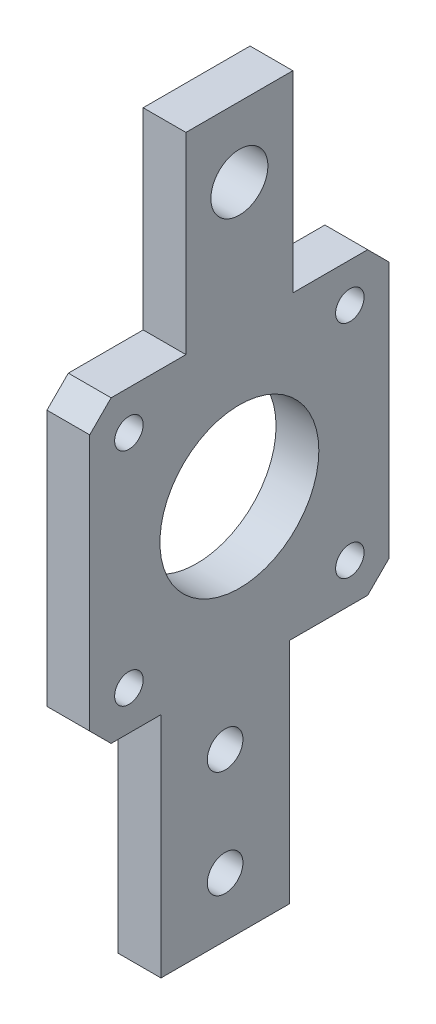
ISO-10303-21;
HEADER;
FILE_DESCRIPTION(('STEP AP214'),'2;1');
FILE_NAME('part.step','',(''),(''),'','','');
FILE_SCHEMA(('AUTOMOTIVE_DESIGN { 1 0 10303 214 1 1 1 1 }'));
ENDSEC;
DATA;
#1=APPLICATION_CONTEXT('core data for automotive mechanical design processes');
#2=APPLICATION_PROTOCOL_DEFINITION('international standard','automotive_design',2000,#1);
#3=PRODUCT_CONTEXT('',#1,'mechanical');
#4=PRODUCT('Part','Part','',(#3));
#5=PRODUCT_RELATED_PRODUCT_CATEGORY('part','',(#4));
#6=PRODUCT_DEFINITION_FORMATION('','',#4);
#7=PRODUCT_DEFINITION_CONTEXT('part definition',#1,'design');
#8=PRODUCT_DEFINITION('design','',#6,#7);
#9=PRODUCT_DEFINITION_SHAPE('','',#8);
#10=(LENGTH_UNIT() NAMED_UNIT(*) SI_UNIT(.MILLI.,.METRE.));
#11=(NAMED_UNIT(*) PLANE_ANGLE_UNIT() SI_UNIT($,.RADIAN.));
#12=(NAMED_UNIT(*) SI_UNIT($,.STERADIAN.) SOLID_ANGLE_UNIT());
#13=UNCERTAINTY_MEASURE_WITH_UNIT(LENGTH_MEASURE(1.E-05),#10,'distance_accuracy_value','');
#14=(GEOMETRIC_REPRESENTATION_CONTEXT(3) GLOBAL_UNCERTAINTY_ASSIGNED_CONTEXT((#13)) GLOBAL_UNIT_ASSIGNED_CONTEXT((#10,
#11,#12)) REPRESENTATION_CONTEXT('',''));
#15=CARTESIAN_POINT('',(0.,0.,0.));
#16=DIRECTION('',(0.,0.,1.));
#17=DIRECTION('',(1.,0.,0.));
#18=AXIS2_PLACEMENT_3D('',#15,#16,#17);
#19=CARTESIAN_POINT('',(3.00000002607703,-36.9999995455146,10.9999999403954));
#20=DIRECTION('',(0.,0.,1.));
#21=DIRECTION('',(1.,0.,0.));
#22=AXIS2_PLACEMENT_3D('',#19,#20,#21);
#23=PLANE('',#22);
#24=DIRECTION('',(1.,0.,0.));
#25=VECTOR('',#24,1.);
#26=CARTESIAN_POINT('',(3.00000002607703,-20.9999997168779,10.9999999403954));
#27=LINE('',#26,#25);
#28=CARTESIAN_POINT('',(0.,-20.9999997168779,10.9999999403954));
#29=VERTEX_POINT('',#28);
#30=CARTESIAN_POINT('',(6.00000005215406,-20.9999997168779,10.9999999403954));
#31=VERTEX_POINT('',#30);
#32=EDGE_CURVE('E262',#29,#31,#27,.T.);
#33=ORIENTED_EDGE('',*,*,#32,.F.);
#34=DIRECTION('',(0.,1.,0.));
#35=VECTOR('',#34,1.);
#36=CARTESIAN_POINT('',(0.,-36.9999995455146,10.9999999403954));
#37=LINE('',#36,#35);
#38=CARTESIAN_POINT('',(0.,-52.9999993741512,10.9999999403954));
#39=VERTEX_POINT('',#38);
#40=EDGE_CURVE('E223',#29,#39,#37,.F.);
#41=ORIENTED_EDGE('',*,*,#40,.T.);
#42=DIRECTION('',(1.,0.,0.));
#43=VECTOR('',#42,1.);
#44=CARTESIAN_POINT('',(3.00000002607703,-52.9999993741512,10.9999999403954));
#45=LINE('',#44,#43);
#46=CARTESIAN_POINT('',(6.00000005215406,-52.9999993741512,10.9999999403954));
#47=VERTEX_POINT('',#46);
#48=EDGE_CURVE('E271',#39,#47,#45,.T.);
#49=ORIENTED_EDGE('',*,*,#48,.T.);
#50=DIRECTION('',(0.,-1.,0.));
#51=VECTOR('',#50,1.);
#52=CARTESIAN_POINT('',(6.00000005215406,-6.99999928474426,10.9999999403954));
#53=LINE('',#52,#51);
#54=EDGE_CURVE('E268',#31,#47,#53,.T.);
#55=ORIENTED_EDGE('',*,*,#54,.F.);
#56=EDGE_LOOP('',(#33,#41,#49,#55));
#57=FACE_BOUND('',#56,.T.);
#58=ADVANCED_FACE('F64',(#57),#23,.T.);
#59=CARTESIAN_POINT('',(3.00000002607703,-52.9999993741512,1.99999986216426));
#60=DIRECTION('',(0.,-1.,0.));
#61=DIRECTION('',(0.,0.,-1.));
#62=AXIS2_PLACEMENT_3D('',#59,#60,#61);
#63=PLANE('',#62);
#64=ORIENTED_EDGE('',*,*,#48,.F.);
#65=DIRECTION('',(0.,0.,1.));
#66=VECTOR('',#65,1.);
#67=CARTESIAN_POINT('',(0.,-52.9999993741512,1.99999986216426));
#68=LINE('',#67,#66);
#69=CARTESIAN_POINT('',(0.,-52.9999993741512,-7.00000021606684));
#70=VERTEX_POINT('',#69);
#71=EDGE_CURVE('E227',#39,#70,#68,.F.);
#72=ORIENTED_EDGE('',*,*,#71,.T.);
#73=DIRECTION('',(-1.,0.,0.));
#74=VECTOR('',#73,1.);
#75=CARTESIAN_POINT('',(3.00000002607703,-52.9999993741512,-7.00000021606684));
#76=LINE('',#75,#74);
#77=CARTESIAN_POINT('',(6.00000005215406,-52.9999993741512,-7.00000021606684));
#78=VERTEX_POINT('',#77);
#79=EDGE_CURVE('E84',#70,#78,#76,.F.);
#80=ORIENTED_EDGE('',*,*,#79,.T.);
#81=DIRECTION('',(0.,0.,-1.));
#82=VECTOR('',#81,1.);
#83=CARTESIAN_POINT('',(6.00000005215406,-52.9999993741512,0.));
#84=LINE('',#83,#82);
#85=EDGE_CURVE('E403',#47,#78,#84,.T.);
#86=ORIENTED_EDGE('',*,*,#85,.F.);
#87=EDGE_LOOP('',(#64,#72,#80,#86));
#88=FACE_BOUND('',#87,.T.);
#89=ADVANCED_FACE('F459',(#88),#63,.T.);
#90=CARTESIAN_POINT('',(3.00000002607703,-36.9999995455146,-7.00000021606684));
#91=DIRECTION('',(0.,0.,1.));
#92=DIRECTION('',(1.,0.,0.));
#93=AXIS2_PLACEMENT_3D('',#90,#91,#92);
#94=PLANE('',#93);
#95=ORIENTED_EDGE('',*,*,#79,.F.);
#96=DIRECTION('',(0.,1.,0.));
#97=VECTOR('',#96,1.);
#98=CARTESIAN_POINT('',(0.,-36.9999995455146,-7.00000021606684));
#99=LINE('',#98,#97);
#100=CARTESIAN_POINT('',(0.,-20.9999997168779,-7.00000021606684));
#101=VERTEX_POINT('',#100);
#102=EDGE_CURVE('E228',#70,#101,#99,.T.);
#103=ORIENTED_EDGE('',*,*,#102,.T.);
#104=DIRECTION('',(-1.,0.,0.));
#105=VECTOR('',#104,1.);
#106=CARTESIAN_POINT('',(3.00000002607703,-20.9999997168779,-7.00000021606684));
#107=LINE('',#106,#105);
#108=CARTESIAN_POINT('',(6.00000005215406,-20.9999997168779,-7.00000021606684));
#109=VERTEX_POINT('',#108);
#110=EDGE_CURVE('E289',#101,#109,#107,.F.);
#111=ORIENTED_EDGE('',*,*,#110,.T.);
#112=DIRECTION('',(0.,-1.,0.));
#113=VECTOR('',#112,1.);
#114=CARTESIAN_POINT('',(6.00000005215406,-6.99999928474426,-7.00000021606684));
#115=LINE('',#114,#113);
#116=EDGE_CURVE('E297',#78,#109,#115,.F.);
#117=ORIENTED_EDGE('',*,*,#116,.F.);
#118=EDGE_LOOP('',(#95,#103,#111,#117));
#119=FACE_BOUND('',#118,.T.);
#120=ADVANCED_FACE('F456',(#119),#94,.F.);
#121=CARTESIAN_POINT('',(3.00000002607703,-19.4999991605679,19.4999991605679));
#122=DIRECTION('',(0.,-0.707106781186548,0.707106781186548));
#123=DIRECTION('',(0.,-0.707106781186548,-0.707106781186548));
#124=AXIS2_PLACEMENT_3D('',#121,#122,#123);
#125=PLANE('',#124);
#126=DIRECTION('',(0.,-0.707106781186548,-0.707106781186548));
#127=VECTOR('',#126,1.);
#128=CARTESIAN_POINT('',(6.00000005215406,-22.99999880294,15.9999995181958));
#129=LINE('',#128,#127);
#130=CARTESIAN_POINT('',(6.00000005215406,-17.9999986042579,20.9999997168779));
#131=VERTEX_POINT('',#130);
#132=CARTESIAN_POINT('',(6.00000005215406,-20.9999997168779,17.9999986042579));
#133=VERTEX_POINT('',#132);
#134=EDGE_CURVE('E192',#131,#133,#129,.T.);
#135=ORIENTED_EDGE('',*,*,#134,.F.);
#136=DIRECTION('',(-1.,0.,0.));
#137=VECTOR('',#136,1.);
#138=CARTESIAN_POINT('',(3.00000002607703,-17.9999986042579,20.9999997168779));
#139=LINE('',#138,#137);
#140=CARTESIAN_POINT('',(0.,-17.9999986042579,20.9999997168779));
#141=VERTEX_POINT('',#140);
#142=EDGE_CURVE('E185',#131,#141,#139,.T.);
#143=ORIENTED_EDGE('',*,*,#142,.T.);
#144=DIRECTION('',(0.,0.707106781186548,0.707106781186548));
#145=VECTOR('',#144,1.);
#146=CARTESIAN_POINT('',(0.,-19.4999991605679,19.4999991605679));
#147=LINE('',#146,#145);
#148=CARTESIAN_POINT('',(0.,-20.9999997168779,17.9999986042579));
#149=VERTEX_POINT('',#148);
#150=EDGE_CURVE('E190',#141,#149,#147,.F.);
#151=ORIENTED_EDGE('',*,*,#150,.T.);
#152=DIRECTION('',(1.,0.,0.));
#153=VECTOR('',#152,1.);
#154=CARTESIAN_POINT('',(3.00000002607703,-20.9999997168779,17.9999986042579));
#155=LINE('',#154,#153);
#156=EDGE_CURVE('E214',#149,#133,#155,.T.);
#157=ORIENTED_EDGE('',*,*,#156,.T.);
#158=EDGE_LOOP('',(#135,#143,#151,#157));
#159=FACE_BOUND('',#158,.T.);
#160=ADVANCED_FACE('F187',(#159),#125,.T.);
#161=CARTESIAN_POINT('',(3.00000002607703,0.,20.9999997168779));
#162=DIRECTION('',(0.,0.,1.));
#163=DIRECTION('',(1.,0.,0.));
#164=AXIS2_PLACEMENT_3D('',#161,#162,#163);
#165=PLANE('',#164);
#166=ORIENTED_EDGE('',*,*,#142,.F.);
#167=DIRECTION('',(0.,1.,0.));
#168=VECTOR('',#167,1.);
#169=CARTESIAN_POINT('',(6.00000005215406,0.,20.9999997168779));
#170=LINE('',#169,#168);
#171=CARTESIAN_POINT('',(6.00000005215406,17.9999986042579,20.9999997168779));
#172=VERTEX_POINT('',#171);
#173=EDGE_CURVE('E196',#131,#172,#170,.T.);
#174=ORIENTED_EDGE('',*,*,#173,.T.);
#175=DIRECTION('',(-1.,0.,0.));
#176=VECTOR('',#175,1.);
#177=CARTESIAN_POINT('',(3.00000002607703,17.9999986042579,20.9999997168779));
#178=LINE('',#177,#176);
#179=CARTESIAN_POINT('',(0.,17.9999986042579,20.9999997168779));
#180=VERTEX_POINT('',#179);
#181=EDGE_CURVE('E202',#172,#180,#178,.T.);
#182=ORIENTED_EDGE('',*,*,#181,.T.);
#183=DIRECTION('',(0.,1.,0.));
#184=VECTOR('',#183,1.);
#185=CARTESIAN_POINT('',(0.,0.,20.9999997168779));
#186=LINE('',#185,#184);
#187=EDGE_CURVE('E199',#180,#141,#186,.F.);
#188=ORIENTED_EDGE('',*,*,#187,.T.);
#189=EDGE_LOOP('',(#166,#174,#182,#188));
#190=FACE_BOUND('',#189,.T.);
#191=ADVANCED_FACE('F200',(#190),#165,.T.);
#192=CARTESIAN_POINT('',(3.00000002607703,19.4999991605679,19.4999991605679));
#193=DIRECTION('',(0.,0.707106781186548,0.707106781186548));
#194=DIRECTION('',(0.,-0.707106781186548,0.707106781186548));
#195=AXIS2_PLACEMENT_3D('',#192,#193,#194);
#196=PLANE('',#195);
#197=ORIENTED_EDGE('',*,*,#181,.F.);
#198=DIRECTION('',(0.,-0.707106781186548,0.707106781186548));
#199=VECTOR('',#198,1.);
#200=CARTESIAN_POINT('',(6.00000005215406,15.9999995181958,22.9999988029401));
#201=LINE('',#200,#199);
#202=CARTESIAN_POINT('',(6.00000005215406,20.9999997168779,17.9999986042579));
#203=VERTEX_POINT('',#202);
#204=EDGE_CURVE('E275',#203,#172,#201,.T.);
#205=ORIENTED_EDGE('',*,*,#204,.F.);
#206=DIRECTION('',(-1.,0.,0.));
#207=VECTOR('',#206,1.);
#208=CARTESIAN_POINT('',(3.00000002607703,20.9999997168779,17.9999986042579));
#209=LINE('',#208,#207);
#210=CARTESIAN_POINT('',(0.,20.9999997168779,17.9999986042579));
#211=VERTEX_POINT('',#210);
#212=EDGE_CURVE('E272',#203,#211,#209,.T.);
#213=ORIENTED_EDGE('',*,*,#212,.T.);
#214=DIRECTION('',(0.,0.707106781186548,-0.707106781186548));
#215=VECTOR('',#214,1.);
#216=CARTESIAN_POINT('',(0.,19.4999991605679,19.4999991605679));
#217=LINE('',#216,#215);
#218=EDGE_CURVE('E207',#211,#180,#217,.F.);
#219=ORIENTED_EDGE('',*,*,#218,.T.);
#220=EDGE_LOOP('',(#197,#205,#213,#219));
#221=FACE_BOUND('',#220,.T.);
#222=ADVANCED_FACE('F491',(#221),#196,.T.);
#223=CARTESIAN_POINT('',(3.00000002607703,20.9999997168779,-12.7499995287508));
#224=DIRECTION('',(0.,1.,0.));
#225=DIRECTION('',(0.,0.,1.));
#226=AXIS2_PLACEMENT_3D('',#223,#224,#225);
#227=PLANE('',#226);
#228=DIRECTION('',(0.,0.,1.));
#229=VECTOR('',#228,1.);
#230=CARTESIAN_POINT('',(6.00000005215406,20.9999997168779,0.));
#231=LINE('',#230,#229);
#232=CARTESIAN_POINT('',(6.00000005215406,20.9999997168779,-17.9999986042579));
#233=VERTEX_POINT('',#232);
#234=CARTESIAN_POINT('',(6.00000005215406,20.9999997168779,-7.49999983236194));
#235=VERTEX_POINT('',#234);
#236=EDGE_CURVE('E235',#233,#235,#231,.T.);
#237=ORIENTED_EDGE('',*,*,#236,.F.);
#238=DIRECTION('',(1.,0.,0.));
#239=VECTOR('',#238,1.);
#240=CARTESIAN_POINT('',(3.00000002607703,20.9999997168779,-17.9999986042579));
#241=LINE('',#240,#239);
#242=CARTESIAN_POINT('',(0.,20.9999997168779,-17.9999986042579));
#243=VERTEX_POINT('',#242);
#244=EDGE_CURVE('E231',#233,#243,#241,.F.);
#245=ORIENTED_EDGE('',*,*,#244,.T.);
#246=DIRECTION('',(0.,0.,-1.));
#247=VECTOR('',#246,1.);
#248=CARTESIAN_POINT('',(0.,20.9999997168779,-12.7499995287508));
#249=LINE('',#248,#247);
#250=CARTESIAN_POINT('',(0.,20.9999997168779,-7.49999983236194));
#251=VERTEX_POINT('',#250);
#252=EDGE_CURVE('E236',#243,#251,#249,.F.);
#253=ORIENTED_EDGE('',*,*,#252,.T.);
#254=DIRECTION('',(-1.,0.,0.));
#255=VECTOR('',#254,1.);
#256=CARTESIAN_POINT('',(3.00000002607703,20.9999997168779,-7.49999983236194));
#257=LINE('',#256,#255);
#258=EDGE_CURVE('E298',#251,#235,#257,.F.);
#259=ORIENTED_EDGE('',*,*,#258,.T.);
#260=EDGE_LOOP('',(#237,#245,#253,#259));
#261=FACE_BOUND('',#260,.T.);
#262=ADVANCED_FACE('F429',(#261),#227,.T.);
#263=CARTESIAN_POINT('',(6.00000005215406,-6.99999928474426,0.));
#264=DIRECTION('',(1.,0.,0.));
#265=DIRECTION('',(0.,0.,-1.));
#266=AXIS2_PLACEMENT_3D('',#263,#264,#265);
#267=PLANE('',#266);
#268=CARTESIAN_POINT('',(6.00000005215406,38.2,0.));
#269=DIRECTION('',(1.,0.,0.));
#270=DIRECTION('',(0.,0.,-1.));
#271=AXIS2_PLACEMENT_3D('',#268,#269,#270);
#272=CIRCLE('',#271,4.);
#273=CARTESIAN_POINT('',(6.00000005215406,38.2,-4.));
#274=VERTEX_POINT('',#273);
#275=EDGE_CURVE('E352',#274,#274,#272,.T.);
#276=ORIENTED_EDGE('',*,*,#275,.F.);
#277=EDGE_LOOP('',(#276));
#278=FACE_BOUND('',#277,.T.);
#279=CARTESIAN_POINT('',(6.00000005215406,-44.7299993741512,1.99999986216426));
#280=DIRECTION('',(1.,0.,0.));
#281=DIRECTION('',(0.,0.,-1.));
#282=AXIS2_PLACEMENT_3D('',#279,#280,#281);
#283=CIRCLE('',#282,2.5);
#284=CARTESIAN_POINT('',(6.00000005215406,-44.7299993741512,-0.500000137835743));
#285=VERTEX_POINT('',#284);
#286=EDGE_CURVE('E354',#285,#285,#283,.T.);
#287=ORIENTED_EDGE('',*,*,#286,.F.);
#288=EDGE_LOOP('',(#287));
#289=FACE_BOUND('',#288,.T.);
#290=CARTESIAN_POINT('',(6.00000005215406,-29.7299993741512,1.99999986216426));
#291=DIRECTION('',(1.,0.,0.));
#292=DIRECTION('',(0.,0.,-1.));
#293=AXIS2_PLACEMENT_3D('',#290,#291,#292);
#294=CIRCLE('',#293,2.5);
#295=CARTESIAN_POINT('',(6.00000005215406,-29.7299993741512,-0.500000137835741));
#296=VERTEX_POINT('',#295);
#297=EDGE_CURVE('E346',#296,#296,#294,.T.);
#298=ORIENTED_EDGE('',*,*,#297,.F.);
#299=EDGE_LOOP('',(#298));
#300=FACE_BOUND('',#299,.T.);
#301=CARTESIAN_POINT('',(6.00000005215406,0.,0.));
#302=DIRECTION('',(1.,0.,0.));
#303=DIRECTION('',(0.,0.,-1.));
#304=AXIS2_PLACEMENT_3D('',#301,#302,#303);
#305=CIRCLE('',#304,11.15);
#306=CARTESIAN_POINT('',(6.00000005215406,0.,-11.15));
#307=VERTEX_POINT('',#306);
#308=EDGE_CURVE('E374',#307,#307,#305,.T.);
#309=ORIENTED_EDGE('',*,*,#308,.F.);
#310=EDGE_LOOP('',(#309));
#311=FACE_BOUND('',#310,.T.);
#312=CARTESIAN_POINT('',(6.00000005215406,15.4999997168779,15.4999997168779));
#313=DIRECTION('',(1.,0.,0.));
#314=DIRECTION('',(0.,0.,1.));
#315=AXIS2_PLACEMENT_3D('',#312,#313,#314);
#316=CIRCLE('',#315,2.);
#317=CARTESIAN_POINT('',(6.00000005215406,15.4999997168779,17.4999997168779));
#318=VERTEX_POINT('',#317);
#319=EDGE_CURVE('E370',#318,#318,#316,.T.);
#320=ORIENTED_EDGE('',*,*,#319,.F.);
#321=EDGE_LOOP('',(#320));
#322=FACE_BOUND('',#321,.T.);
#323=CARTESIAN_POINT('',(6.00000005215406,-15.5000002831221,15.4999997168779));
#324=DIRECTION('',(1.,0.,0.));
#325=DIRECTION('',(0.,0.,1.));
#326=AXIS2_PLACEMENT_3D('',#323,#324,#325);
#327=CIRCLE('',#326,2.);
#328=CARTESIAN_POINT('',(6.00000005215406,-15.5000002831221,17.4999997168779));
#329=VERTEX_POINT('',#328);
#330=EDGE_CURVE('E366',#329,#329,#327,.T.);
#331=ORIENTED_EDGE('',*,*,#330,.F.);
#332=EDGE_LOOP('',(#331));
#333=FACE_BOUND('',#332,.T.);
#334=CARTESIAN_POINT('',(6.00000005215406,-15.5000002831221,-15.4999997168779));
#335=DIRECTION('',(1.,0.,0.));
#336=DIRECTION('',(0.,0.,-1.));
#337=AXIS2_PLACEMENT_3D('',#334,#335,#336);
#338=CIRCLE('',#337,2.00000000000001);
#339=CARTESIAN_POINT('',(6.00000005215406,-15.5000002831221,-17.4999997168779));
#340=VERTEX_POINT('',#339);
#341=EDGE_CURVE('E362',#340,#340,#338,.T.);
#342=ORIENTED_EDGE('',*,*,#341,.F.);
#343=EDGE_LOOP('',(#342));
#344=FACE_BOUND('',#343,.T.);
#345=CARTESIAN_POINT('',(6.00000005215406,15.4999997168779,-15.4999997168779));
#346=DIRECTION('',(1.,0.,0.));
#347=DIRECTION('',(0.,0.,-1.));
#348=AXIS2_PLACEMENT_3D('',#345,#346,#347);
#349=CIRCLE('',#348,2.);
#350=CARTESIAN_POINT('',(6.00000005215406,15.4999997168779,-17.4999997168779));
#351=VERTEX_POINT('',#350);
#352=EDGE_CURVE('E323',#351,#351,#349,.T.);
#353=ORIENTED_EDGE('',*,*,#352,.F.);
#354=EDGE_LOOP('',(#353));
#355=FACE_BOUND('',#354,.T.);
#356=DIRECTION('',(0.,1.,0.));
#357=VECTOR('',#356,1.);
#358=CARTESIAN_POINT('',(6.00000005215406,0.,-20.9999997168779));
#359=LINE('',#358,#357);
#360=CARTESIAN_POINT('',(6.00000005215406,17.9999986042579,-20.9999997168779));
#361=VERTEX_POINT('',#360);
#362=CARTESIAN_POINT('',(6.00000005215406,-17.9999986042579,-20.9999997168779));
#363=VERTEX_POINT('',#362);
#364=EDGE_CURVE('E75',#361,#363,#359,.F.);
#365=ORIENTED_EDGE('',*,*,#364,.F.);
#366=DIRECTION('',(0.,-0.707106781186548,-0.707106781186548));
#367=VECTOR('',#366,1.);
#368=CARTESIAN_POINT('',(6.00000005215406,15.9999995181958,-22.9999988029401));
#369=LINE('',#368,#367);
#370=EDGE_CURVE('E237',#361,#233,#369,.F.);
#371=ORIENTED_EDGE('',*,*,#370,.T.);
#372=ORIENTED_EDGE('',*,*,#236,.T.);
#373=DIRECTION('',(0.,-1.,0.));
#374=VECTOR('',#373,1.);
#375=CARTESIAN_POINT('',(6.00000005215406,-6.99999928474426,-7.49999983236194));
#376=LINE('',#375,#374);
#377=CARTESIAN_POINT('',(6.00000005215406,48.,-7.49999983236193));
#378=VERTEX_POINT('',#377);
#379=EDGE_CURVE('E303',#235,#378,#376,.F.);
#380=ORIENTED_EDGE('',*,*,#379,.T.);
#381=DIRECTION('',(0.,0.,1.));
#382=VECTOR('',#381,1.);
#383=CARTESIAN_POINT('',(6.00000005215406,48.,7.49999983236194));
#384=LINE('',#383,#382);
#385=CARTESIAN_POINT('',(6.00000005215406,48.,7.49999983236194));
#386=VERTEX_POINT('',#385);
#387=EDGE_CURVE('E342',#378,#386,#384,.T.);
#388=ORIENTED_EDGE('',*,*,#387,.T.);
#389=DIRECTION('',(0.,-1.,0.));
#390=VECTOR('',#389,1.);
#391=CARTESIAN_POINT('',(6.00000005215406,-6.99999928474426,7.49999983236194));
#392=LINE('',#391,#390);
#393=CARTESIAN_POINT('',(6.00000005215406,20.9999997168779,7.49999983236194));
#394=VERTEX_POINT('',#393);
#395=EDGE_CURVE('E162',#386,#394,#392,.T.);
#396=ORIENTED_EDGE('',*,*,#395,.T.);
#397=DIRECTION('',(0.,0.,-1.));
#398=VECTOR('',#397,1.);
#399=CARTESIAN_POINT('',(6.00000005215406,20.9999997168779,12.7499995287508));
#400=LINE('',#399,#398);
#401=EDGE_CURVE('E153',#203,#394,#400,.T.);
#402=ORIENTED_EDGE('',*,*,#401,.F.);
#403=ORIENTED_EDGE('',*,*,#204,.T.);
#404=ORIENTED_EDGE('',*,*,#173,.F.);
#405=ORIENTED_EDGE('',*,*,#134,.T.);
#406=DIRECTION('',(0.,0.,-1.));
#407=VECTOR('',#406,1.);
#408=CARTESIAN_POINT('',(6.00000005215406,-20.9999997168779,0.));
#409=LINE('',#408,#407);
#410=EDGE_CURVE('E218',#133,#31,#409,.T.);
#411=ORIENTED_EDGE('',*,*,#410,.T.);
#412=ORIENTED_EDGE('',*,*,#54,.T.);
#413=ORIENTED_EDGE('',*,*,#85,.T.);
#414=ORIENTED_EDGE('',*,*,#116,.T.);
#415=DIRECTION('',(0.,0.,1.));
#416=VECTOR('',#415,1.);
#417=CARTESIAN_POINT('',(6.00000005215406,-20.9999997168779,-12.4999997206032));
#418=LINE('',#417,#416);
#419=CARTESIAN_POINT('',(6.00000005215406,-20.9999997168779,-17.9999986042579));
#420=VERTEX_POINT('',#419);
#421=EDGE_CURVE('E293',#420,#109,#418,.T.);
#422=ORIENTED_EDGE('',*,*,#421,.F.);
#423=DIRECTION('',(0.,-0.707106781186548,0.707106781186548));
#424=VECTOR('',#423,1.);
#425=CARTESIAN_POINT('',(6.00000005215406,-22.9999988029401,-15.9999995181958));
#426=LINE('',#425,#424);
#427=EDGE_CURVE('E255',#420,#363,#426,.F.);
#428=ORIENTED_EDGE('',*,*,#427,.T.);
#429=EDGE_LOOP('',(#365,#371,#372,#380,#388,#396,#402,#403,#404,#405,#411,#412,#413,#414,#422,#428));
#430=FACE_BOUND('',#429,.T.);
#431=ADVANCED_FACE('F439',(#278,#289,#300,#311,#322,#333,#344,#355,#430),#267,.T.);
#432=CARTESIAN_POINT('',(0.,-6.99999928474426,0.));
#433=DIRECTION('',(1.,0.,0.));
#434=DIRECTION('',(0.,0.,-1.));
#435=AXIS2_PLACEMENT_3D('',#432,#433,#434);
#436=PLANE('',#435);
#437=CARTESIAN_POINT('',(0.,38.2,0.));
#438=DIRECTION('',(1.,0.,0.));
#439=DIRECTION('',(0.,0.,-1.));
#440=AXIS2_PLACEMENT_3D('',#437,#438,#439);
#441=CIRCLE('',#440,4.);
#442=CARTESIAN_POINT('',(0.,38.2,-4.));
#443=VERTEX_POINT('',#442);
#444=EDGE_CURVE('E339',#443,#443,#441,.F.);
#445=ORIENTED_EDGE('',*,*,#444,.F.);
#446=EDGE_LOOP('',(#445));
#447=FACE_BOUND('',#446,.T.);
#448=CARTESIAN_POINT('',(0.,-44.7299993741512,1.99999986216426));
#449=DIRECTION('',(1.,0.,0.));
#450=DIRECTION('',(0.,0.,-1.));
#451=AXIS2_PLACEMENT_3D('',#448,#449,#450);
#452=CIRCLE('',#451,2.5);
#453=CARTESIAN_POINT('',(0.,-44.7299993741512,-0.500000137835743));
#454=VERTEX_POINT('',#453);
#455=EDGE_CURVE('E68',#454,#454,#452,.F.);
#456=ORIENTED_EDGE('',*,*,#455,.F.);
#457=EDGE_LOOP('',(#456));
#458=FACE_BOUND('',#457,.T.);
#459=CARTESIAN_POINT('',(0.,-29.7299993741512,1.99999986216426));
#460=DIRECTION('',(1.,0.,0.));
#461=DIRECTION('',(0.,0.,-1.));
#462=AXIS2_PLACEMENT_3D('',#459,#460,#461);
#463=CIRCLE('',#462,2.5);
#464=CARTESIAN_POINT('',(0.,-29.7299993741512,-0.500000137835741));
#465=VERTEX_POINT('',#464);
#466=EDGE_CURVE('E343',#465,#465,#463,.F.);
#467=ORIENTED_EDGE('',*,*,#466,.F.);
#468=EDGE_LOOP('',(#467));
#469=FACE_BOUND('',#468,.T.);
#470=CARTESIAN_POINT('',(0.,0.,0.));
#471=DIRECTION('',(1.,0.,0.));
#472=DIRECTION('',(0.,0.,-1.));
#473=AXIS2_PLACEMENT_3D('',#470,#471,#472);
#474=CIRCLE('',#473,11.15);
#475=CARTESIAN_POINT('',(0.,0.,-11.15));
#476=VERTEX_POINT('',#475);
#477=EDGE_CURVE('E335',#476,#476,#474,.F.);
#478=ORIENTED_EDGE('',*,*,#477,.F.);
#479=EDGE_LOOP('',(#478));
#480=FACE_BOUND('',#479,.T.);
#481=CARTESIAN_POINT('',(0.,15.4999997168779,15.4999997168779));
#482=DIRECTION('',(1.,0.,0.));
#483=DIRECTION('',(0.,0.,-1.));
#484=AXIS2_PLACEMENT_3D('',#481,#482,#483);
#485=CIRCLE('',#484,2.);
#486=CARTESIAN_POINT('',(0.,15.4999997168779,13.4999997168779));
#487=VERTEX_POINT('',#486);
#488=EDGE_CURVE('E331',#487,#487,#485,.F.);
#489=ORIENTED_EDGE('',*,*,#488,.F.);
#490=EDGE_LOOP('',(#489));
#491=FACE_BOUND('',#490,.T.);
#492=CARTESIAN_POINT('',(0.,-15.5000002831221,15.4999997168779));
#493=DIRECTION('',(1.,0.,0.));
#494=DIRECTION('',(0.,0.,-1.));
#495=AXIS2_PLACEMENT_3D('',#492,#493,#494);
#496=CIRCLE('',#495,2.);
#497=CARTESIAN_POINT('',(0.,-15.5000002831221,13.4999997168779));
#498=VERTEX_POINT('',#497);
#499=EDGE_CURVE('E327',#498,#498,#496,.F.);
#500=ORIENTED_EDGE('',*,*,#499,.F.);
#501=EDGE_LOOP('',(#500));
#502=FACE_BOUND('',#501,.T.);
#503=CARTESIAN_POINT('',(0.,-15.5000002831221,-15.4999997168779));
#504=DIRECTION('',(1.,0.,0.));
#505=DIRECTION('',(0.,0.,-1.));
#506=AXIS2_PLACEMENT_3D('',#503,#504,#505);
#507=CIRCLE('',#506,2.00000000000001);
#508=CARTESIAN_POINT('',(0.,-15.5000002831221,-17.4999997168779));
#509=VERTEX_POINT('',#508);
#510=EDGE_CURVE('E322',#509,#509,#507,.F.);
#511=ORIENTED_EDGE('',*,*,#510,.F.);
#512=EDGE_LOOP('',(#511));
#513=FACE_BOUND('',#512,.T.);
#514=CARTESIAN_POINT('',(0.,15.4999997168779,-15.4999997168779));
#515=DIRECTION('',(1.,0.,0.));
#516=DIRECTION('',(0.,0.,-1.));
#517=AXIS2_PLACEMENT_3D('',#514,#515,#516);
#518=CIRCLE('',#517,2.);
#519=CARTESIAN_POINT('',(0.,15.4999997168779,-17.4999997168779));
#520=VERTEX_POINT('',#519);
#521=EDGE_CURVE('E318',#520,#520,#518,.F.);
#522=ORIENTED_EDGE('',*,*,#521,.F.);
#523=EDGE_LOOP('',(#522));
#524=FACE_BOUND('',#523,.T.);
#525=DIRECTION('',(0.,0.707106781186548,0.707106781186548));
#526=VECTOR('',#525,1.);
#527=CARTESIAN_POINT('',(0.,19.4999991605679,-19.4999991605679));
#528=LINE('',#527,#526);
#529=CARTESIAN_POINT('',(0.,17.9999986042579,-20.9999997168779));
#530=VERTEX_POINT('',#529);
#531=EDGE_CURVE('E12',#530,#243,#528,.T.);
#532=ORIENTED_EDGE('',*,*,#531,.F.);
#533=DIRECTION('',(0.,1.,0.));
#534=VECTOR('',#533,1.);
#535=CARTESIAN_POINT('',(0.,0.,-20.9999997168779));
#536=LINE('',#535,#534);
#537=CARTESIAN_POINT('',(0.,-17.9999986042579,-20.9999997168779));
#538=VERTEX_POINT('',#537);
#539=EDGE_CURVE('E244',#538,#530,#536,.T.);
#540=ORIENTED_EDGE('',*,*,#539,.F.);
#541=DIRECTION('',(0.,0.707106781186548,-0.707106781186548));
#542=VECTOR('',#541,1.);
#543=CARTESIAN_POINT('',(0.,-19.4999991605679,-19.4999991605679));
#544=LINE('',#543,#542);
#545=CARTESIAN_POINT('',(0.,-20.9999997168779,-17.9999986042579));
#546=VERTEX_POINT('',#545);
#547=EDGE_CURVE('E251',#546,#538,#544,.T.);
#548=ORIENTED_EDGE('',*,*,#547,.F.);
#549=DIRECTION('',(0.,0.,1.));
#550=VECTOR('',#549,1.);
#551=CARTESIAN_POINT('',(0.,-20.9999997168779,-12.4999997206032));
#552=LINE('',#551,#550);
#553=EDGE_CURVE('E285',#101,#546,#552,.F.);
#554=ORIENTED_EDGE('',*,*,#553,.F.);
#555=ORIENTED_EDGE('',*,*,#102,.F.);
#556=ORIENTED_EDGE('',*,*,#71,.F.);
#557=ORIENTED_EDGE('',*,*,#40,.F.);
#558=DIRECTION('',(0.,0.,1.));
#559=VECTOR('',#558,1.);
#560=CARTESIAN_POINT('',(0.,-20.9999997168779,14.4999995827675));
#561=LINE('',#560,#559);
#562=EDGE_CURVE('E212',#149,#29,#561,.F.);
#563=ORIENTED_EDGE('',*,*,#562,.F.);
#564=ORIENTED_EDGE('',*,*,#150,.F.);
#565=ORIENTED_EDGE('',*,*,#187,.F.);
#566=ORIENTED_EDGE('',*,*,#218,.F.);
#567=DIRECTION('',(0.,0.,-1.));
#568=VECTOR('',#567,1.);
#569=CARTESIAN_POINT('',(0.,20.9999997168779,12.7499995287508));
#570=LINE('',#569,#568);
#571=CARTESIAN_POINT('',(0.,20.9999997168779,7.49999983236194));
#572=VERTEX_POINT('',#571);
#573=EDGE_CURVE('E276',#572,#211,#570,.F.);
#574=ORIENTED_EDGE('',*,*,#573,.F.);
#575=DIRECTION('',(0.,1.,0.));
#576=VECTOR('',#575,1.);
#577=CARTESIAN_POINT('',(0.,30.0000002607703,7.49999983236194));
#578=LINE('',#577,#576);
#579=CARTESIAN_POINT('',(0.,48.,7.49999983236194));
#580=VERTEX_POINT('',#579);
#581=EDGE_CURVE('E306',#580,#572,#578,.F.);
#582=ORIENTED_EDGE('',*,*,#581,.F.);
#583=DIRECTION('',(0.,0.,-1.));
#584=VECTOR('',#583,1.);
#585=CARTESIAN_POINT('',(0.,48.,7.49999983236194));
#586=LINE('',#585,#584);
#587=CARTESIAN_POINT('',(0.,48.,-7.49999983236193));
#588=VERTEX_POINT('',#587);
#589=EDGE_CURVE('E388',#588,#580,#586,.F.);
#590=ORIENTED_EDGE('',*,*,#589,.F.);
#591=DIRECTION('',(0.,1.,0.));
#592=VECTOR('',#591,1.);
#593=CARTESIAN_POINT('',(0.,30.0000002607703,-7.49999983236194));
#594=LINE('',#593,#592);
#595=EDGE_CURVE('E302',#251,#588,#594,.T.);
#596=ORIENTED_EDGE('',*,*,#595,.F.);
#597=ORIENTED_EDGE('',*,*,#252,.F.);
#598=EDGE_LOOP('',(#532,#540,#548,#554,#555,#556,#557,#563,#564,#565,#566,#574,#582,#590,#596,#597));
#599=FACE_BOUND('',#598,.T.);
#600=ADVANCED_FACE('F209',(#447,#458,#469,#480,#491,#502,#513,#524,#599),#436,.F.);
#601=CARTESIAN_POINT('',(3.00000002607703,19.4999991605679,-19.4999991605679));
#602=DIRECTION('',(0.,-0.707106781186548,0.707106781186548));
#603=DIRECTION('',(0.,-0.707106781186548,-0.707106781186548));
#604=AXIS2_PLACEMENT_3D('',#601,#602,#603);
#605=PLANE('',#604);
#606=DIRECTION('',(-1.,0.,0.));
#607=VECTOR('',#606,1.);
#608=CARTESIAN_POINT('',(3.00000002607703,17.9999986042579,-20.9999997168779));
#609=LINE('',#608,#607);
#610=EDGE_CURVE('E239',#361,#530,#609,.T.);
#611=ORIENTED_EDGE('',*,*,#610,.T.);
#612=ORIENTED_EDGE('',*,*,#531,.T.);
#613=ORIENTED_EDGE('',*,*,#244,.F.);
#614=ORIENTED_EDGE('',*,*,#370,.F.);
#615=EDGE_LOOP('',(#611,#612,#613,#614));
#616=FACE_BOUND('',#615,.T.);
#617=ADVANCED_FACE('F442',(#616),#605,.F.);
#618=CARTESIAN_POINT('',(3.00000002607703,0.,-20.9999997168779));
#619=DIRECTION('',(0.,0.,1.));
#620=DIRECTION('',(1.,0.,0.));
#621=AXIS2_PLACEMENT_3D('',#618,#619,#620);
#622=PLANE('',#621);
#623=ORIENTED_EDGE('',*,*,#610,.F.);
#624=ORIENTED_EDGE('',*,*,#364,.T.);
#625=DIRECTION('',(-1.,0.,0.));
#626=VECTOR('',#625,1.);
#627=CARTESIAN_POINT('',(3.00000002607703,-17.9999986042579,-20.9999997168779));
#628=LINE('',#627,#626);
#629=EDGE_CURVE('E248',#363,#538,#628,.T.);
#630=ORIENTED_EDGE('',*,*,#629,.T.);
#631=ORIENTED_EDGE('',*,*,#539,.T.);
#632=EDGE_LOOP('',(#623,#624,#630,#631));
#633=FACE_BOUND('',#632,.T.);
#634=ADVANCED_FACE('F446',(#633),#622,.F.);
#635=CARTESIAN_POINT('',(3.00000002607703,-19.4999991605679,-19.4999991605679));
#636=DIRECTION('',(0.,0.707106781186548,0.707106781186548));
#637=DIRECTION('',(0.,-0.707106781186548,0.707106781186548));
#638=AXIS2_PLACEMENT_3D('',#635,#636,#637);
#639=PLANE('',#638);
#640=DIRECTION('',(1.,0.,0.));
#641=VECTOR('',#640,1.);
#642=CARTESIAN_POINT('',(3.00000002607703,-20.9999997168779,-17.9999986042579));
#643=LINE('',#642,#641);
#644=EDGE_CURVE('E259',#420,#546,#643,.F.);
#645=ORIENTED_EDGE('',*,*,#644,.T.);
#646=ORIENTED_EDGE('',*,*,#547,.T.);
#647=ORIENTED_EDGE('',*,*,#629,.F.);
#648=ORIENTED_EDGE('',*,*,#427,.F.);
#649=EDGE_LOOP('',(#645,#646,#647,#648));
#650=FACE_BOUND('',#649,.T.);
#651=ADVANCED_FACE('F450',(#650),#639,.F.);
#652=CARTESIAN_POINT('',(3.00000002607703,-20.9999997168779,14.4999995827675));
#653=DIRECTION('',(0.,-1.,0.));
#654=DIRECTION('',(0.,0.,-1.));
#655=AXIS2_PLACEMENT_3D('',#652,#653,#654);
#656=PLANE('',#655);
#657=ORIENTED_EDGE('',*,*,#562,.T.);
#658=ORIENTED_EDGE('',*,*,#32,.T.);
#659=ORIENTED_EDGE('',*,*,#410,.F.);
#660=ORIENTED_EDGE('',*,*,#156,.F.);
#661=EDGE_LOOP('',(#657,#658,#659,#660));
#662=FACE_BOUND('',#661,.T.);
#663=ADVANCED_FACE('F465',(#662),#656,.T.);
#664=CARTESIAN_POINT('',(3.00000002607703,20.9999997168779,12.7499995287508));
#665=DIRECTION('',(0.,1.,0.));
#666=DIRECTION('',(0.,0.,1.));
#667=AXIS2_PLACEMENT_3D('',#664,#665,#666);
#668=PLANE('',#667);
#669=ORIENTED_EDGE('',*,*,#212,.F.);
#670=ORIENTED_EDGE('',*,*,#401,.T.);
#671=DIRECTION('',(-1.,0.,0.));
#672=VECTOR('',#671,1.);
#673=CARTESIAN_POINT('',(3.00000002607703,20.9999997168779,7.49999983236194));
#674=LINE('',#673,#672);
#675=EDGE_CURVE('E311',#394,#572,#674,.T.);
#676=ORIENTED_EDGE('',*,*,#675,.T.);
#677=ORIENTED_EDGE('',*,*,#573,.T.);
#678=EDGE_LOOP('',(#669,#670,#676,#677));
#679=FACE_BOUND('',#678,.T.);
#680=ADVANCED_FACE('F467',(#679),#668,.T.);
#681=CARTESIAN_POINT('',(3.00000002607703,-20.9999997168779,-12.4999997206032));
#682=DIRECTION('',(0.,-1.,0.));
#683=DIRECTION('',(0.,0.,-1.));
#684=AXIS2_PLACEMENT_3D('',#681,#682,#683);
#685=PLANE('',#684);
#686=ORIENTED_EDGE('',*,*,#644,.F.);
#687=ORIENTED_EDGE('',*,*,#421,.T.);
#688=ORIENTED_EDGE('',*,*,#110,.F.);
#689=ORIENTED_EDGE('',*,*,#553,.T.);
#690=EDGE_LOOP('',(#686,#687,#688,#689));
#691=FACE_BOUND('',#690,.T.);
#692=ADVANCED_FACE('F455',(#691),#685,.T.);
#693=CARTESIAN_POINT('',(3.00000002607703,30.0000002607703,-7.49999983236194));
#694=DIRECTION('',(0.,0.,1.));
#695=DIRECTION('',(1.,0.,0.));
#696=AXIS2_PLACEMENT_3D('',#693,#694,#695);
#697=PLANE('',#696);
#698=ORIENTED_EDGE('',*,*,#258,.F.);
#699=ORIENTED_EDGE('',*,*,#595,.T.);
#700=DIRECTION('',(1.,0.,0.));
#701=VECTOR('',#700,1.);
#702=CARTESIAN_POINT('',(-109.384641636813,48.,-7.49999983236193));
#703=LINE('',#702,#701);
#704=EDGE_CURVE('E387',#588,#378,#703,.T.);
#705=ORIENTED_EDGE('',*,*,#704,.T.);
#706=ORIENTED_EDGE('',*,*,#379,.F.);
#707=EDGE_LOOP('',(#698,#699,#705,#706));
#708=FACE_BOUND('',#707,.T.);
#709=ADVANCED_FACE('F436',(#708),#697,.F.);
#710=CARTESIAN_POINT('',(3.00000002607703,30.0000002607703,7.49999983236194));
#711=DIRECTION('',(0.,0.,1.));
#712=DIRECTION('',(1.,0.,0.));
#713=AXIS2_PLACEMENT_3D('',#710,#711,#712);
#714=PLANE('',#713);
#715=ORIENTED_EDGE('',*,*,#395,.F.);
#716=DIRECTION('',(1.,0.,0.));
#717=VECTOR('',#716,1.);
#718=CARTESIAN_POINT('',(-109.384641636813,48.,7.49999983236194));
#719=LINE('',#718,#717);
#720=EDGE_CURVE('E312',#580,#386,#719,.T.);
#721=ORIENTED_EDGE('',*,*,#720,.F.);
#722=ORIENTED_EDGE('',*,*,#581,.T.);
#723=ORIENTED_EDGE('',*,*,#675,.F.);
#724=EDGE_LOOP('',(#715,#721,#722,#723));
#725=FACE_BOUND('',#724,.T.);
#726=ADVANCED_FACE('F66',(#725),#714,.T.);
#727=CARTESIAN_POINT('',(-109.384641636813,48.,7.49999983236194));
#728=DIRECTION('',(0.,1.,0.));
#729=DIRECTION('',(0.,0.,1.));
#730=AXIS2_PLACEMENT_3D('',#727,#728,#729);
#731=PLANE('',#730);
#732=ORIENTED_EDGE('',*,*,#704,.F.);
#733=ORIENTED_EDGE('',*,*,#589,.T.);
#734=ORIENTED_EDGE('',*,*,#720,.T.);
#735=ORIENTED_EDGE('',*,*,#387,.F.);
#736=EDGE_LOOP('',(#732,#733,#734,#735));
#737=FACE_BOUND('',#736,.T.);
#738=ADVANCED_FACE('F482',(#737),#731,.T.);
#739=CARTESIAN_POINT('',(-3.99999994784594,15.4999997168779,-15.4999997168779));
#740=DIRECTION('',(1.,0.,0.));
#741=DIRECTION('',(0.,0.,-1.));
#742=AXIS2_PLACEMENT_3D('',#739,#740,#741);
#743=CYLINDRICAL_SURFACE('',#742,2.);
#744=ORIENTED_EDGE('',*,*,#521,.T.);
#745=EDGE_LOOP('',(#744));
#746=FACE_BOUND('',#745,.T.);
#747=ORIENTED_EDGE('',*,*,#352,.T.);
#748=EDGE_LOOP('',(#747));
#749=FACE_BOUND('',#748,.T.);
#750=ADVANCED_FACE('F625',(#746,#749),#743,.F.);
#751=CARTESIAN_POINT('',(-3.99999994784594,-15.5000002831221,-15.4999997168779));
#752=DIRECTION('',(1.,0.,0.));
#753=DIRECTION('',(0.,0.,-1.));
#754=AXIS2_PLACEMENT_3D('',#751,#752,#753);
#755=CYLINDRICAL_SURFACE('',#754,2.00000000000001);
#756=ORIENTED_EDGE('',*,*,#510,.T.);
#757=EDGE_LOOP('',(#756));
#758=FACE_BOUND('',#757,.T.);
#759=ORIENTED_EDGE('',*,*,#341,.T.);
#760=EDGE_LOOP('',(#759));
#761=FACE_BOUND('',#760,.T.);
#762=ADVANCED_FACE('F621',(#758,#761),#755,.F.);
#763=CARTESIAN_POINT('',(-3.99999994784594,-15.5000002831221,15.4999997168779));
#764=DIRECTION('',(1.,0.,0.));
#765=DIRECTION('',(0.,0.,-1.));
#766=AXIS2_PLACEMENT_3D('',#763,#764,#765);
#767=CYLINDRICAL_SURFACE('',#766,2.);
#768=ORIENTED_EDGE('',*,*,#499,.T.);
#769=EDGE_LOOP('',(#768));
#770=FACE_BOUND('',#769,.T.);
#771=ORIENTED_EDGE('',*,*,#330,.T.);
#772=EDGE_LOOP('',(#771));
#773=FACE_BOUND('',#772,.T.);
#774=ADVANCED_FACE('F624',(#770,#773),#767,.F.);
#775=CARTESIAN_POINT('',(-3.99999994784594,15.4999997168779,15.4999997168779));
#776=DIRECTION('',(1.,0.,0.));
#777=DIRECTION('',(0.,0.,-1.));
#778=AXIS2_PLACEMENT_3D('',#775,#776,#777);
#779=CYLINDRICAL_SURFACE('',#778,2.);
#780=ORIENTED_EDGE('',*,*,#488,.T.);
#781=EDGE_LOOP('',(#780));
#782=FACE_BOUND('',#781,.T.);
#783=ORIENTED_EDGE('',*,*,#319,.T.);
#784=EDGE_LOOP('',(#783));
#785=FACE_BOUND('',#784,.T.);
#786=ADVANCED_FACE('F629',(#782,#785),#779,.F.);
#787=CARTESIAN_POINT('',(-3.99999994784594,0.,0.));
#788=DIRECTION('',(1.,0.,0.));
#789=DIRECTION('',(0.,0.,-1.));
#790=AXIS2_PLACEMENT_3D('',#787,#788,#789);
#791=CYLINDRICAL_SURFACE('',#790,11.15);
#792=ORIENTED_EDGE('',*,*,#477,.T.);
#793=EDGE_LOOP('',(#792));
#794=FACE_BOUND('',#793,.T.);
#795=ORIENTED_EDGE('',*,*,#308,.T.);
#796=EDGE_LOOP('',(#795));
#797=FACE_BOUND('',#796,.T.);
#798=ADVANCED_FACE('F594',(#794,#797),#791,.F.);
#799=CARTESIAN_POINT('',(-3.99999994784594,38.2,0.));
#800=DIRECTION('',(1.,0.,0.));
#801=DIRECTION('',(0.,0.,-1.));
#802=AXIS2_PLACEMENT_3D('',#799,#800,#801);
#803=CYLINDRICAL_SURFACE('',#802,4.);
#804=ORIENTED_EDGE('',*,*,#444,.T.);
#805=EDGE_LOOP('',(#804));
#806=FACE_BOUND('',#805,.T.);
#807=ORIENTED_EDGE('',*,*,#275,.T.);
#808=EDGE_LOOP('',(#807));
#809=FACE_BOUND('',#808,.T.);
#810=ADVANCED_FACE('F589',(#806,#809),#803,.F.);
#811=CARTESIAN_POINT('',(-3.99999994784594,-29.7299993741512,1.99999986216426));
#812=DIRECTION('',(1.,0.,0.));
#813=DIRECTION('',(0.,0.,-1.));
#814=AXIS2_PLACEMENT_3D('',#811,#812,#813);
#815=CYLINDRICAL_SURFACE('',#814,2.5);
#816=ORIENTED_EDGE('',*,*,#466,.T.);
#817=EDGE_LOOP('',(#816));
#818=FACE_BOUND('',#817,.T.);
#819=ORIENTED_EDGE('',*,*,#297,.T.);
#820=EDGE_LOOP('',(#819));
#821=FACE_BOUND('',#820,.T.);
#822=ADVANCED_FACE('F593',(#818,#821),#815,.F.);
#823=CARTESIAN_POINT('',(-3.99999994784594,-44.7299993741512,1.99999986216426));
#824=DIRECTION('',(1.,0.,0.));
#825=DIRECTION('',(0.,0.,-1.));
#826=AXIS2_PLACEMENT_3D('',#823,#824,#825);
#827=CYLINDRICAL_SURFACE('',#826,2.5);
#828=ORIENTED_EDGE('',*,*,#455,.T.);
#829=EDGE_LOOP('',(#828));
#830=FACE_BOUND('',#829,.T.);
#831=ORIENTED_EDGE('',*,*,#286,.T.);
#832=EDGE_LOOP('',(#831));
#833=FACE_BOUND('',#832,.T.);
#834=ADVANCED_FACE('F607',(#830,#833),#827,.F.);
#835=CLOSED_SHELL('',(#58,#89,#120,#160,#191,#222,#262,#431,#600,#617,#634,#651,#663,#680,#692,
#709,#726,#738,#750,#762,#774,#786,#798,#810,#822,#834));
#836=MANIFOLD_SOLID_BREP('B2',#835);
#837=ADVANCED_BREP_SHAPE_REPRESENTATION('',(#18,#836),#14);
#838=SHAPE_DEFINITION_REPRESENTATION(#9,#837);
ENDSEC;
END-ISO-10303-21;
